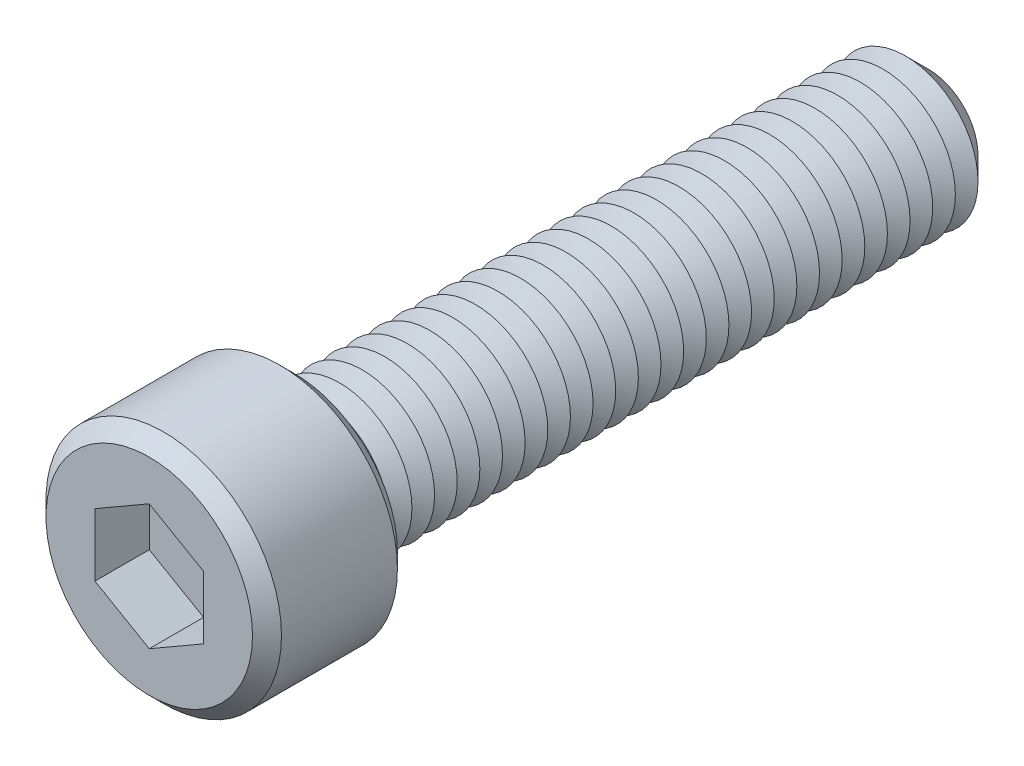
from build123d import *

# Parameters (mm, degrees)
SKETCH1_R           = 6.5
BOSS_EXTRUDE1_DEPTH = 8
SKETCH2_R           = 4
BOSS_EXTRUDE2_DEPTH = 35
CHAMFER1_SIZE       = 1.25
LPATTERN1_COUNT     = 27
LPATTERN1_PITCH     = 1.25
CUT_EXTRUDE1_DEPTH  = 3
SKETCH6_R           = 0.9
CUT_EXTRUDE2_DEPTH  = 40
CHAMFER2_SIZE       = 0.8


with BuildPart() as part:
    # Sketch1 → Boss-Extrude1 (new body)
    with BuildSketch(Plane.XY):
        Circle(SKETCH1_R)
    extrude(amount=BOSS_EXTRUDE1_DEPTH)

    # Sketch2 → Boss-Extrude2 (add)
    with BuildSketch(Plane(origin=(0, 0, 0), x_dir=(-1, 0, 0), z_dir=(0, 0, -1))):
        Circle(SKETCH2_R)
    extrude(amount=BOSS_EXTRUDE2_DEPTH)

    # Chamfer1
    chamfer1_edges = [part.edges().sort_by_distance(p)[0] for p in [
        (4, 0, -35),
    ]]
    chamfer(chamfer1_edges, length=CHAMFER1_SIZE)

    # Sketch4 → Cut-Revolve1 (revolve, cut)
    with BuildSketch(Plane(origin=(0, 0, 0), x_dir=(0, 0, -1), z_dir=(1, 0, 0)), mode=Mode.PRIVATE) as cut_revolve1_sk:
        Polygon((0, 4), (0.625, 2.917468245), (1.25, 4), align=None)
    cut_revolve1 = revolve(cut_revolve1_sk.sketch.rotate(Axis((0, 0, 2.512122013), (0, 0, -1)), 90), axis=Axis((0, 0, 2.512122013), (0, 0, -1)), mode=Mode.SUBTRACT)

    # LPattern1: Cut-Revolve1 ×27
    with Locations(*[(0, 0, -i * LPATTERN1_PITCH) for i in range(1, LPATTERN1_COUNT)]):
        add(cut_revolve1, mode=Mode.SUBTRACT)

    # Sketch5 → Cut-Extrude1 (cut)
    with BuildSketch(Plane.XY.offset(8)):
        Polygon((0, 3.464101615), (-3, 1.732050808), (-3, -1.732050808), (0, -3.464101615), (3, -1.732050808), (3, 1.732050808), align=None)
    extrude(amount=-CUT_EXTRUDE1_DEPTH, mode=Mode.SUBTRACT)

    # Sketch6 → Cut-Extrude2 (cut)
    with BuildSketch(Plane.XY.offset(5)):
        Circle(SKETCH6_R)
    extrude(amount=-CUT_EXTRUDE2_DEPTH, mode=Mode.SUBTRACT)

    # Chamfer2
    chamfer2_edges = [part.edges().sort_by_distance(p)[0] for p in [
        (-6.5, 0, 0),
        (-6.5, 0, 8),
    ]]
    chamfer(chamfer2_edges, length=CHAMFER2_SIZE)


solid = part.part
